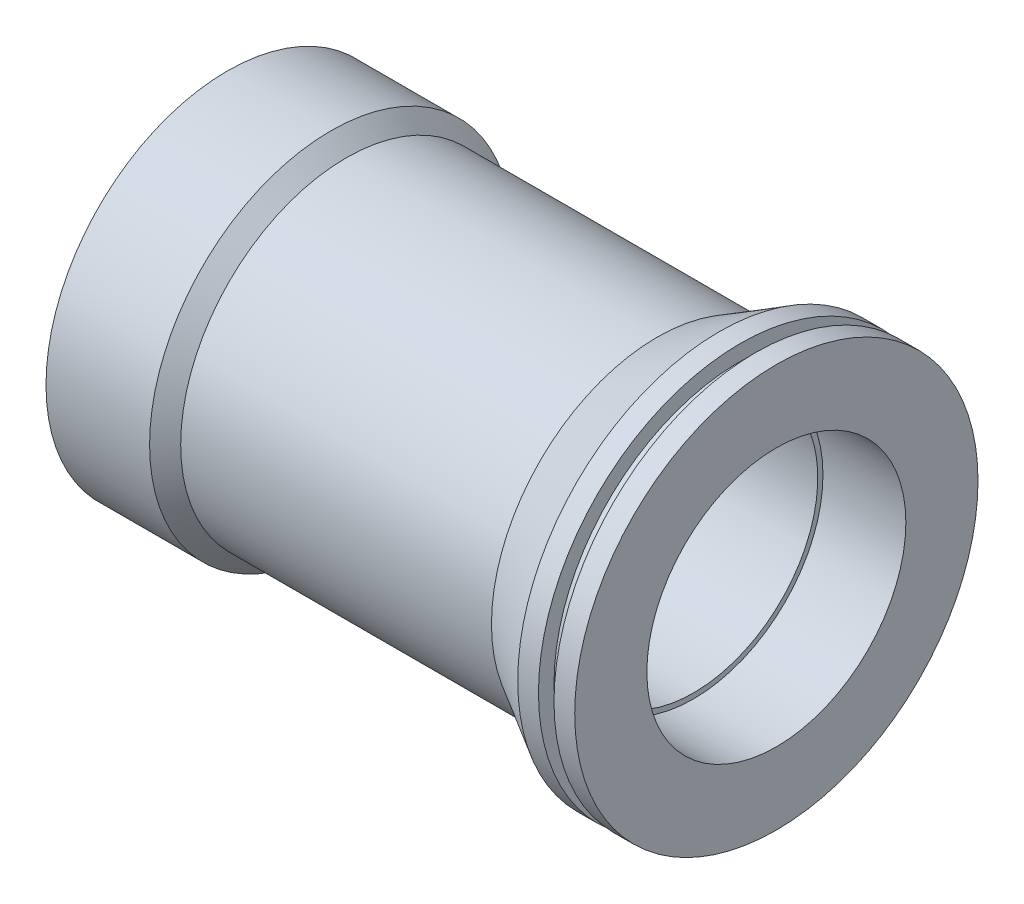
from build123d import *


with BuildPart() as part:
    # Esquisse2 → R_volution1 (revolve)
    with BuildSketch(Plane.XY, mode=Mode.PRIVATE) as r_volution1_sk:
        Polygon((88.40653975, 38.92820323), (84.40653975, 38.92820323), (84.40653975, 35.92820323), (81.40653975, 35.92820323), (81.40653975, 38.92820323), (77.40653975, 38.92820323), (65.40653975, 32), (5.40653975, 32), (2.40653975, 35), (-17.59346025, 35), (-17.59346025, 30), (-2.59346025, 30), (-2.59346025, 22), (7.40653975, 22), (7.40653975, 23), (27.40653975, 23), (27.40653975, 24), (72.40653975, 24), (72.40653975, 25), (88.40653975, 25), align=None)
    revolve(r_volution1_sk.sketch.rotate(Axis((-89.207905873, 0, 0), (1, 0, 0)), 90), axis=Axis((-89.207905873, 0, 0), (1, 0, 0)))


solid = part.part
